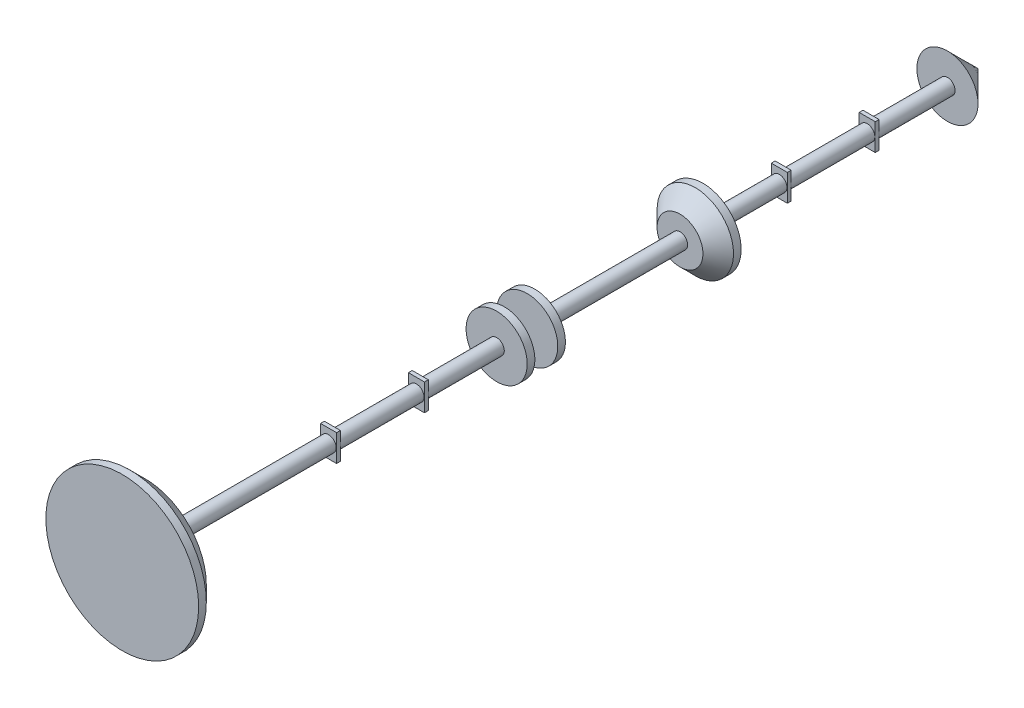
from build123d import *

# Parameters (mm, degrees)
ESQUISSE1_R                  = 10
EXTRUSION1_DEPTH             = 240
ESQUISSE2_W                  = 21
ESQUISSE2_H                  = 35
EXTRUSION2_DEPTH             = 5
EXTRUSION3_START             = 110
ESQUISSE3_R                  = 10
EXTRUSION3_DEPTH             = 110
ESQUISSE4_W                  = 21
ESQUISSE4_H                  = 35
EXTRUSION4_DEPTH             = 5
EXTRUSION5_START             = 100
ESQUISSE5_R                  = 10
EXTRUSION5_DEPTH             = 100
ESQUISSE7_R                  = 100
EXTRUSION7_DEPTH             = 30
ESQUISSE12_R                 = 40
EXTRUSION10_DEPTH            = 10
EXTRUSION11_START            = 30
ESQUISSE13_R                 = 10
EXTRUSION11_DEPTH            = 30
ESQUISSE14_R                 = 40
EXTRUSION12_DEPTH            = 10
EXTRUSION13_START            = 190
ESQUISSE15_R                 = 10
EXTRUSION13_DEPTH            = 190
ESQUISSE16_R                 = 50
EXTRUSION14_DEPTH            = 30
EXTRUSION15_START            = 100
ESQUISSE26_R                 = 10
EXTRUSION15_DEPTH            = 100
ESQUISSE29_W                 = 21
ESQUISSE29_H                 = 35
EXTRUSION16_DEPTH            = 5
EXTRUSION17_START            = 110
ESQUISSE30_R                 = 10
EXTRUSION17_DEPTH            = 110
ESQUISSE31_W                 = 21
ESQUISSE31_H                 = 35
EXTRUSION18_DEPTH            = 5
EXTRUSION19_START            = 100
ESQUISSE32_R                 = 10
EXTRUSION19_DEPTH            = 100
ENL_V_MAT_EXTRU_1_DEPTH      = 20
ENL_V_MAT_EXTRU_1_DEPTH_BACK = 20
ESQUISSE34_W                 = 80
ESQUISSE34_H                 = 30
CHANFREIN4_SIZE              = 20
CHANFREIN5_SIZE              = 20


with BuildPart() as part:
    # Esquisse1 → Extrusion1 (new body)
    with BuildSketch(Plane.XY):
        Circle(ESQUISSE1_R)
    extrude(amount=EXTRUSION1_DEPTH)

    # Esquisse2 → Extrusion2 (add)
    with BuildSketch(Plane(origin=(0, 0, 0), x_dir=(-1, 0, 0), z_dir=(0, 0, -1))):
        Rectangle(ESQUISSE2_W, ESQUISSE2_H)
    extrude(amount=EXTRUSION2_DEPTH)

    # Esquisse3 → Extrusion3 (add)
    with BuildSketch(Plane(origin=(0, 0, -5), x_dir=(-1, 0, 0), z_dir=(0, 0, -1)).offset(EXTRUSION3_START)):
        Circle(ESQUISSE3_R)
    extrude(amount=-EXTRUSION3_DEPTH)

    # Esquisse4 → Extrusion4 (add)
    with BuildSketch(Plane(origin=(0, 0, -115), x_dir=(-1, 0, 0), z_dir=(0, 0, -1))):
        Rectangle(ESQUISSE4_W, ESQUISSE4_H)
    extrude(amount=EXTRUSION4_DEPTH)

    # Esquisse5 → Extrusion5 (add)
    with BuildSketch(Plane(origin=(0, 0, -120), x_dir=(-1, 0, 0), z_dir=(0, 0, -1)).offset(EXTRUSION5_START)):
        Circle(ESQUISSE5_R)
    extrude(amount=-EXTRUSION5_DEPTH)

    # Esquisse7 → Extrusion7 (add)
    with BuildSketch(Plane.XY.offset(240)):
        Circle(ESQUISSE7_R)
    extrude(amount=EXTRUSION7_DEPTH)

    # Esquisse12 → Extrusion10 (add)
    with BuildSketch(Plane(origin=(0, 0, -220), x_dir=(-1, 0, 0), z_dir=(0, 0, -1))):
        Circle(ESQUISSE12_R)
    extrude(amount=EXTRUSION10_DEPTH)

    # Esquisse13 → Extrusion11 (add)
    with BuildSketch(Plane(origin=(0, 0, -230), x_dir=(-1, 0, 0), z_dir=(0, 0, -1)).offset(EXTRUSION11_START)):
        Circle(ESQUISSE13_R)
    extrude(amount=-EXTRUSION11_DEPTH)

    # Esquisse14 → Extrusion12 (add)
    with BuildSketch(Plane(origin=(0, 0, -260), x_dir=(-1, 0, 0), z_dir=(0, 0, -1))):
        Circle(ESQUISSE14_R)
    extrude(amount=EXTRUSION12_DEPTH)

    # Esquisse15 → Extrusion13 (add)
    with BuildSketch(Plane(origin=(0, 0, -270), x_dir=(-1, 0, 0), z_dir=(0, 0, -1)).offset(EXTRUSION13_START)):
        Circle(ESQUISSE15_R)
    extrude(amount=-EXTRUSION13_DEPTH)

    # Esquisse16 → Extrusion14 (add)
    with BuildSketch(Plane(origin=(0, 0, -460), x_dir=(-1, 0, 0), z_dir=(0, 0, -1))):
        Circle(ESQUISSE16_R)
    extrude(amount=EXTRUSION14_DEPTH)

    # Esquisse26 → Extrusion15 (add)
    with BuildSketch(Plane(origin=(0, 0, -490), x_dir=(-1, 0, 0), z_dir=(0, 0, -1)).offset(EXTRUSION15_START)):
        Circle(ESQUISSE26_R)
    extrude(amount=-EXTRUSION15_DEPTH)

    # Esquisse29 → Extrusion16 (add)
    with BuildSketch(Plane(origin=(0, 0, -590), x_dir=(-1, 0, 0), z_dir=(0, 0, -1))):
        Rectangle(ESQUISSE29_W, ESQUISSE29_H)
    extrude(amount=EXTRUSION16_DEPTH)

    # Esquisse30 → Extrusion17 (add)
    with BuildSketch(Plane(origin=(0, 0, -595), x_dir=(-1, 0, 0), z_dir=(0, 0, -1)).offset(EXTRUSION17_START)):
        Circle(ESQUISSE30_R)
    extrude(amount=-EXTRUSION17_DEPTH)

    # Esquisse31 → Extrusion18 (add)
    with BuildSketch(Plane(origin=(0, 0, -705), x_dir=(-1, 0, 0), z_dir=(0, 0, -1))):
        Rectangle(ESQUISSE31_W, ESQUISSE31_H)
    extrude(amount=EXTRUSION18_DEPTH)

    # Esquisse32 → Extrusion19 (add)
    with BuildSketch(Plane(origin=(0, 0, -710), x_dir=(-1, 0, 0), z_dir=(0, 0, -1)).offset(EXTRUSION19_START)):
        Circle(ESQUISSE32_R)
    extrude(amount=-EXTRUSION19_DEPTH)

    # Esquisse33 → R_volution1 (revolve)
    with BuildSketch(Plane(origin=(0, 0, 0), x_dir=(1, 0, 0), z_dir=(0, 1, 0)), mode=Mode.PRIVATE) as r_volution1_sk:
        Polygon((0, 810), (0, 850), (-40, 810), align=None)
    revolve(r_volution1_sk.sketch.rotate(Axis((0, 0, -810), (0, 0, -1)), 180), axis=Axis((0, 0, -810), (0, 0, -1)))

    # Esquisse34 → Enl_v. mat.-Extru.1 (cut, two sides: drawn at the far end of the back side and taken through both)
    with BuildSketch(Plane(origin=(0, 0, 0), x_dir=(1, 0, 0), z_dir=(0, 1, 0)).offset(-ENL_V_MAT_EXTRU_1_DEPTH_BACK)):
        with Locations((0, 245)):
            Rectangle(ESQUISSE34_W, ESQUISSE34_H)
    extrude(amount=ENL_V_MAT_EXTRU_1_DEPTH + ENL_V_MAT_EXTRU_1_DEPTH_BACK, mode=Mode.SUBTRACT)


with BuildPart() as enl_v_mat_extru_1_piece_1:
    # of the separate pieces the step leaves, piece 1, a body of its own (enl_v_mat_extru_1_pieces)
    add(part.part.solids().sort_by_distance((-40, 0, -230))[0])

    # Chanfrein4
    chanfrein4_edges = [enl_v_mat_extru_1_piece_1.edges().sort_by_distance(p)[0] for p in [
        (-100, 0, 240),
    ]]
    chamfer(chanfrein4_edges, length=CHANFREIN4_SIZE)


with BuildPart() as enl_v_mat_extru_1_piece_2:
    # of the separate pieces the step leaves, piece 2, a body of its own (enl_v_mat_extru_1_pieces)
    add(part.part.solids().sort_by_distance((0, 0, -850))[0])

    # Chanfrein5
    chanfrein5_edges = [enl_v_mat_extru_1_piece_2.edges().sort_by_distance(p)[0] for p in [
        (50, 0, -460),
    ]]
    chamfer(chanfrein5_edges, length=CHANFREIN5_SIZE)


solid = Compound([enl_v_mat_extru_1_piece_1.part, enl_v_mat_extru_1_piece_2.part])
